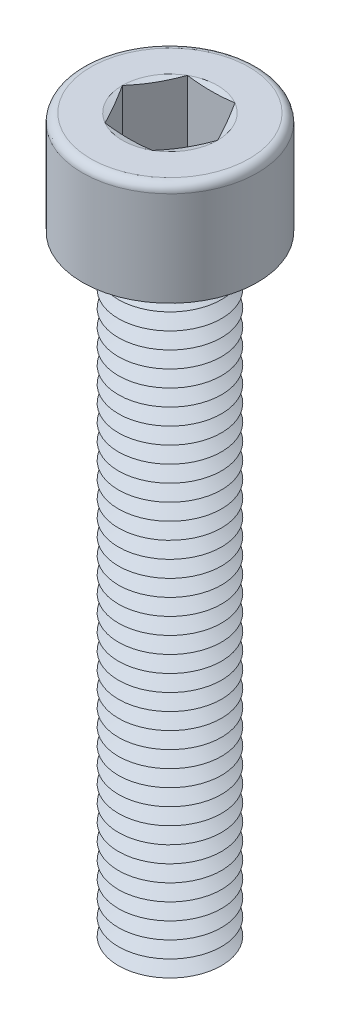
from build123d import *

# Parameters (mm, degrees)
SKETCH1_R       = 2.5
EXTRUDE1_DEPTH  = 30
SKETCH2_R       = 4.25
EXTRUDE2_DEPTH  = 5
EXTRUDE3_DEPTH  = 4
FILLET1_R       = 0.4
LPATTERN1_COUNT = 38
LPATTERN1_PITCH = 0.8


with BuildPart() as part:
    # Sketch1 → Extrude1 (new body)
    with BuildSketch(Plane(origin=(0, 0, 0), x_dir=(1, 0, 0), z_dir=(0, 1, 0))):
        with Locations(Location((0, 0, 0), (0, 0, 270))):
            Circle(SKETCH1_R)
    extrude(amount=EXTRUDE1_DEPTH)

    # Sketch2 → Extrude2 (add)
    with BuildSketch(Plane(origin=(0, 30, 0), x_dir=(1, 0, 0), z_dir=(0, 1, 0))):
        with Locations(Location((0, 0, 0), (0, 0, 270))):
            Circle(SKETCH2_R)
    extrude(amount=EXTRUDE2_DEPTH)

    # Sketch3 → Extrude3 (cut)
    with BuildSketch(Plane(origin=(0, 35, 0), x_dir=(1, 0, 0), z_dir=(0, 1, 0))):
        Polygon((1.154700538, 2), (-1.154700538, 2), (-2.309401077, 0), (-1.154700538, -2), (1.154700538, -2), (2.309401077, 0), align=None)
    extrude(amount=-EXTRUDE3_DEPTH, mode=Mode.SUBTRACT)

    # Fillet1
    fillet1_edges = [part.edges().sort_by_distance(p)[0] for p in [
        (0, 35, -4.25),
    ]]
    fillet(fillet1_edges, radius=FILLET1_R)

    # Sketch4 → Cut-Revolve1 (revolve, cut)
    with BuildSketch(Plane(origin=(0, 0, 0), x_dir=(0, 0, -1), z_dir=(1, 0, 0))):
        Polygon((-2, 31), (0, 31), (0, 29.845299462), align=None)
    revolve(axis=Axis((0, 31, 0), (0, -1, 0)), mode=Mode.SUBTRACT)

    # Sketch5 → Cut-Revolve2 (revolve, cut)
    with BuildSketch(Plane.XY, mode=Mode.PRIVATE) as cut_revolve2_sk:
        Polygon((-2.5, 0.4), (-2.5, -0.4), (-1.807179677, 0), align=None)
    cut_revolve2 = revolve(cut_revolve2_sk.sketch.rotate(Axis((0, 30, 0), (0, -1, 0)), 270), axis=Axis((0, 30, 0), (0, -1, 0)), mode=Mode.SUBTRACT)

    # LPattern1: Cut-Revolve2 ×38
    with Locations(*[(0, i * LPATTERN1_PITCH, 0) for i in range(1, LPATTERN1_COUNT)]):
        add(cut_revolve2, mode=Mode.SUBTRACT)

    # Extrude4 cone 1 section (on through the dimple's axis) → Extrude4 (revolve, cut)
    with BuildSketch(Plane(origin=(0, 35, 0), x_dir=(0, 0, 1), z_dir=(1, 0, 0))):
        Polygon((0, 0), (2.309401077, 0), (0, 0.618802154), align=None)
    revolve(axis=Axis((0, 35, 0), (0, -1, 0)), mode=Mode.SUBTRACT)


solid = part.part
